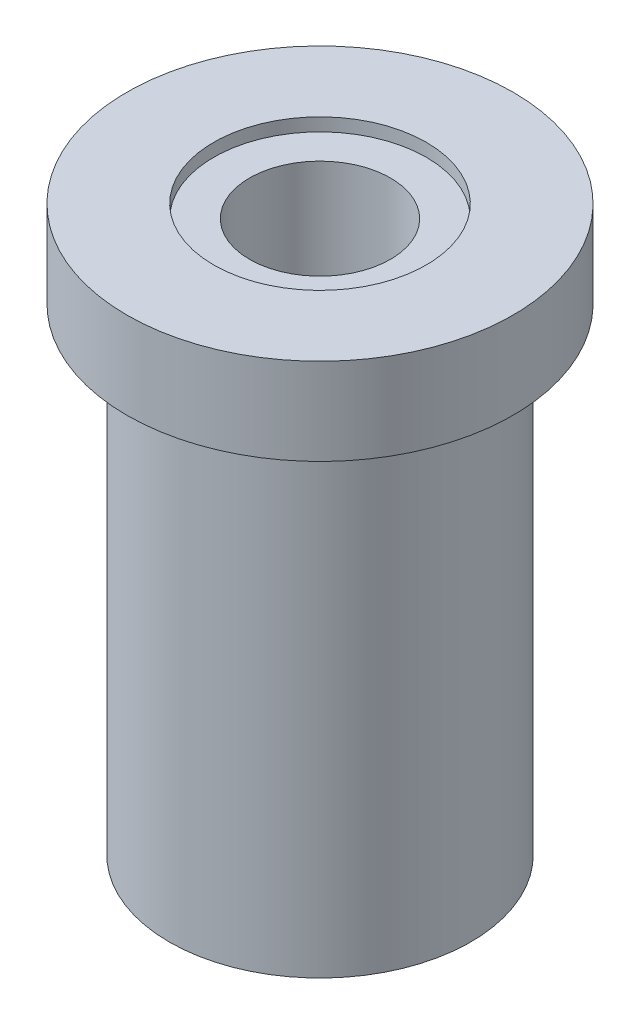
from build123d import *

# Parameters (mm, degrees)
SKICA1_R                 = 6.95
P_IDAT_VYSUNUT_M1_DEPTH  = 22
SKICA2_R                 = 8.9
P_IDAT_VYSUNUT_M2_DEPTH  = 4
ZAOBLIT1_R               = 0.3
SKICA3_R                 = 3.25
ODEBRAT_VYSUNUT_M1_DEPTH = 29.886328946
SKICA4_R                 = 4.9
ODEBRAT_VYSUNUT_M2_DEPTH = 0.6


with BuildPart() as part:
    # Skica1 → P_idat vysunut_m1 (new body)
    with BuildSketch(Plane(origin=(0, 0, 0), x_dir=(1, 0, 0), z_dir=(0, 1, 0))):
        with Locations(Location((0, 0, 0), (0, 0, 270))):
            Circle(SKICA1_R)
    extrude(amount=P_IDAT_VYSUNUT_M1_DEPTH)

    # Skica2 → P_idat vysunut_m2 (add)
    with BuildSketch(Plane(origin=(0, 22, 0), x_dir=(-1, 0, 0), z_dir=(0, 1, 0))):
        with Locations(Location((0, 0, 0), (0, 0, 90))):
            Circle(SKICA2_R)
    extrude(amount=P_IDAT_VYSUNUT_M2_DEPTH)

    # Zaoblit1
    zaoblit1_edges = [part.edges().sort_by_distance(p)[0] for p in [
        (0, 22, -6.95),
    ]]
    fillet(zaoblit1_edges, radius=ZAOBLIT1_R)

    # Skica3 → Odebrat vysunut_m1 (cut, through all)
    with BuildSketch(Plane(origin=(0, 26, 0), x_dir=(1, 0, 0), z_dir=(0, 1, 0))):
        with Locations(Location((0, 0, 0), (0, 0, 270))):
            Circle(SKICA3_R)
    extrude(amount=-ODEBRAT_VYSUNUT_M1_DEPTH, mode=Mode.SUBTRACT)

    # Skica4 → Odebrat vysunut_m2 (cut)
    with BuildSketch(Plane(origin=(0, 26, 0), x_dir=(1, 0, 0), z_dir=(0, 1, 0))):
        with Locations(Location((0, 0, 0), (0, 0, 270))):
            Circle(SKICA4_R)
    extrude(amount=-ODEBRAT_VYSUNUT_M2_DEPTH, mode=Mode.SUBTRACT)


solid = part.part
